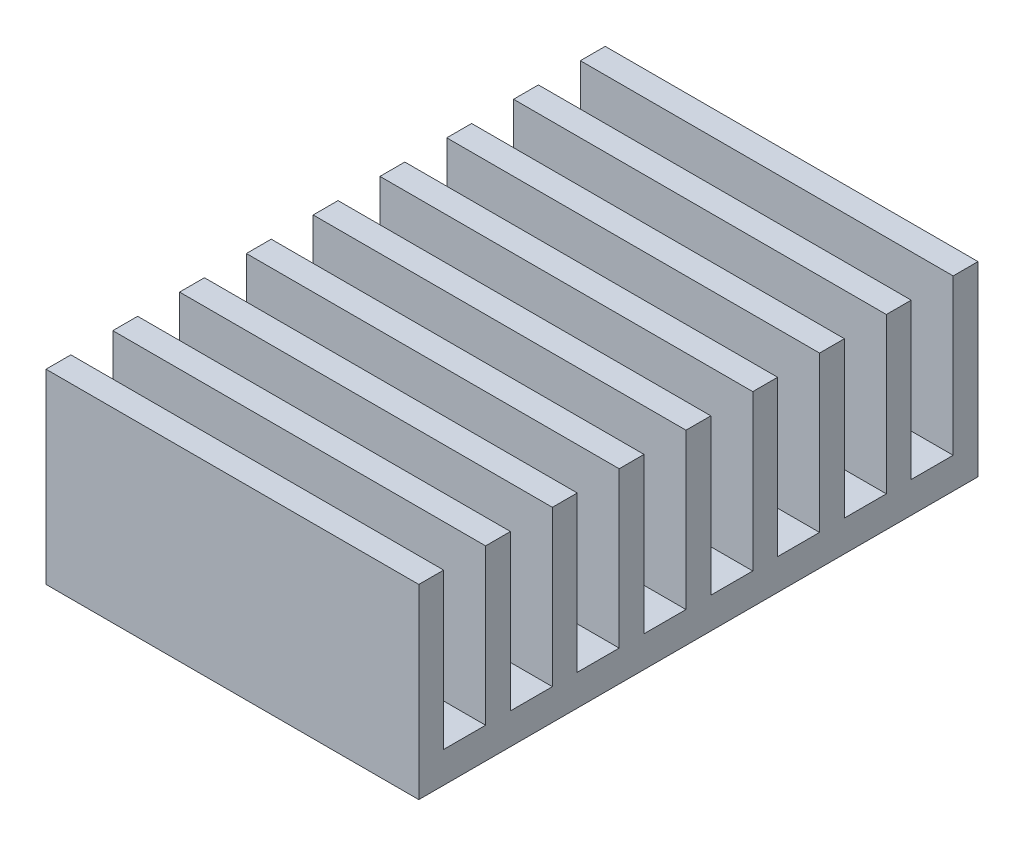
from build123d import *

# Parameters (mm, degrees)
SKETCH1_W           = 45
SKETCH1_H           = 15
BOSS_EXTRUDE1_DEPTH = 15
SKETCH2_W           = 3.375
SKETCH2_H           = 12.5
CUT_EXTRUDE1_DEPTH  = 41.388736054


with BuildPart() as part:
    # Sketch1 → Boss-Extrude1 (new, symmetric)
    with BuildSketch(Plane(origin=(0, 0, 0), x_dir=(0, 0, -1), z_dir=(1, 0, 0))):
        with Locations((0, 7.5)):
            Rectangle(SKETCH1_W, SKETCH1_H)
    extrude(amount=BOSS_EXTRUDE1_DEPTH, both=True)

    # Sketch2 → Cut-Extrude1 (cut, through all)
    with BuildSketch(Plane(origin=(15, 0, 0), x_dir=(0, 0, -1), z_dir=(1, 0, 0))):
        with Locations((-18.8125, 8.75)):
            Rectangle(SKETCH2_W, SKETCH2_H)
        with Locations((-13.4375, 8.75)):
            Rectangle(SKETCH2_W, SKETCH2_H)
        with Locations((-8.0625, 8.75)):
            Rectangle(SKETCH2_W, SKETCH2_H)
        with Locations((-2.6875, 8.75)):
            Rectangle(SKETCH2_W, SKETCH2_H)
        with Locations((2.6875, 8.75)):
            Rectangle(SKETCH2_W, SKETCH2_H)
        with Locations((8.0625, 8.75)):
            Rectangle(SKETCH2_W, SKETCH2_H)
        with Locations((13.4375, 8.75)):
            Rectangle(SKETCH2_W, SKETCH2_H)
        with Locations((18.8125, 8.75)):
            Rectangle(SKETCH2_W, SKETCH2_H)
    extrude(amount=-CUT_EXTRUDE1_DEPTH, mode=Mode.SUBTRACT)


solid = part.part
